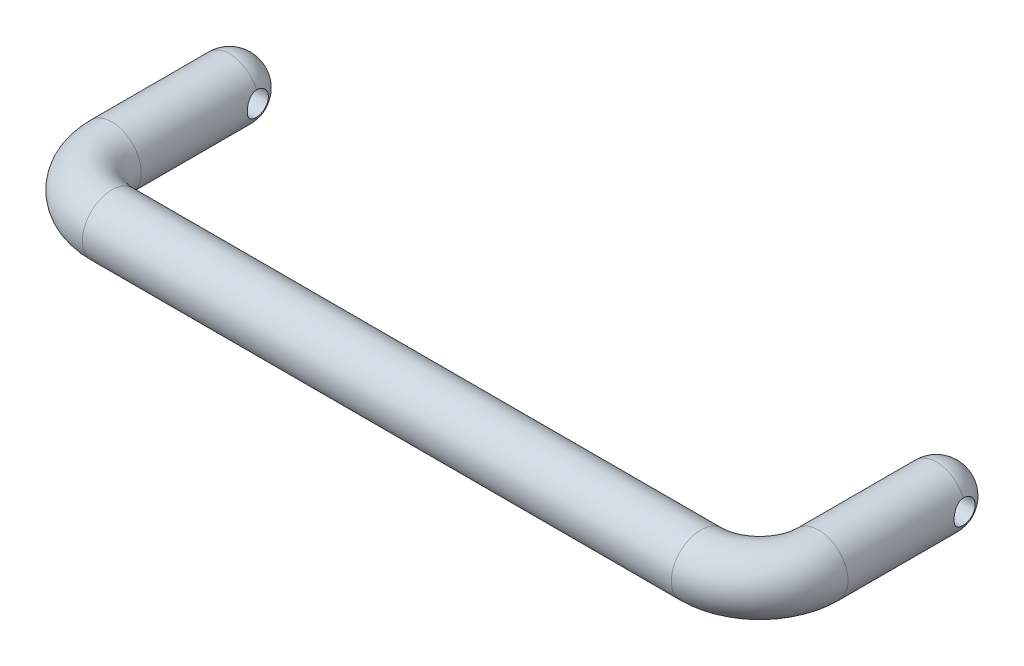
ISO-10303-21;
HEADER;
FILE_DESCRIPTION(('STEP AP214'),'2;1');
FILE_NAME('part.step','',(''),(''),'','','');
FILE_SCHEMA(('AUTOMOTIVE_DESIGN { 1 0 10303 214 1 1 1 1 }'));
ENDSEC;
DATA;
#1=APPLICATION_CONTEXT('core data for automotive mechanical design processes');
#2=APPLICATION_PROTOCOL_DEFINITION('international standard','automotive_design',2000,#1);
#3=PRODUCT_CONTEXT('',#1,'mechanical');
#4=PRODUCT('Part','Part','',(#3));
#5=PRODUCT_RELATED_PRODUCT_CATEGORY('part','',(#4));
#6=PRODUCT_DEFINITION_FORMATION('','',#4);
#7=PRODUCT_DEFINITION_CONTEXT('part definition',#1,'design');
#8=PRODUCT_DEFINITION('design','',#6,#7);
#9=PRODUCT_DEFINITION_SHAPE('','',#8);
#10=(LENGTH_UNIT() NAMED_UNIT(*) SI_UNIT(.MILLI.,.METRE.));
#11=(NAMED_UNIT(*) PLANE_ANGLE_UNIT() SI_UNIT($,.RADIAN.));
#12=(NAMED_UNIT(*) SI_UNIT($,.STERADIAN.) SOLID_ANGLE_UNIT());
#13=UNCERTAINTY_MEASURE_WITH_UNIT(LENGTH_MEASURE(1.E-05),#10,'distance_accuracy_value','');
#14=(GEOMETRIC_REPRESENTATION_CONTEXT(3) GLOBAL_UNCERTAINTY_ASSIGNED_CONTEXT((#13)) GLOBAL_UNIT_ASSIGNED_CONTEXT((#10,
#11,#12)) REPRESENTATION_CONTEXT('',''));
#15=CARTESIAN_POINT('',(0.,0.,0.));
#16=DIRECTION('',(0.,0.,1.));
#17=DIRECTION('',(1.,0.,0.));
#18=AXIS2_PLACEMENT_3D('',#15,#16,#17);
#19=CARTESIAN_POINT('',(120.,0.,20.));
#20=DIRECTION('',(0.,0.,-1.));
#21=DIRECTION('',(0.,1.,0.));
#22=AXIS2_PLACEMENT_3D('',#19,#20,#21);
#23=CYLINDRICAL_SURFACE('',#22,5.);
#24=CARTESIAN_POINT('',(124.582575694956,2.,0.));
#25=CARTESIAN_POINT('',(124.582564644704,2.00000798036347,0.0538058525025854));
#26=CARTESIAN_POINT('',(124.583523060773,1.99782891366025,0.10760566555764));
#27=CARTESIAN_POINT('',(124.587296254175,1.98915905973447,0.214771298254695));
#28=CARTESIAN_POINT('',(124.590110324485,1.98266991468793,0.268137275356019));
#29=CARTESIAN_POINT('',(124.597497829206,1.9654760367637,0.373846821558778));
#30=CARTESIAN_POINT('',(124.602064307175,1.95478796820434,0.42619358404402));
#31=CARTESIAN_POINT('',(124.612800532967,1.92931630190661,0.529700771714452));
#32=CARTESIAN_POINT('',(124.618970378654,1.91453245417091,0.580861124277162));
#33=CARTESIAN_POINT('',(124.639592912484,1.86426971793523,0.731935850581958));
#34=CARTESIAN_POINT('',(124.656174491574,1.82284489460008,0.829654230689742));
#35=CARTESIAN_POINT('',(124.693123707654,1.72548191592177,1.01679558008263));
#36=CARTESIAN_POINT('',(124.71349493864,1.66952996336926,1.10621055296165));
#37=CARTESIAN_POINT('',(124.757009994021,1.54131835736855,1.27926239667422));
#38=CARTESIAN_POINT('',(124.780242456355,1.46836913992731,1.36236721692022));
#39=CARTESIAN_POINT('',(124.826127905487,1.30969646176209,1.51554027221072));
#40=CARTESIAN_POINT('',(124.848780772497,1.22397038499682,1.58560583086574));
#41=CARTESIAN_POINT('',(124.892034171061,1.03800590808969,1.71340639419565));
#42=CARTESIAN_POINT('',(124.912518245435,0.937327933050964,1.77054480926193));
#43=CARTESIAN_POINT('',(124.94803944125,0.726824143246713,1.86684407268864));
#44=CARTESIAN_POINT('',(124.963078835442,0.617002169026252,1.90601242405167));
#45=CARTESIAN_POINT('',(124.985383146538,0.3969674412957,1.96334120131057));
#46=CARTESIAN_POINT('',(124.992989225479,0.287031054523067,1.98242695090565));
#47=CARTESIAN_POINT('',(125.000803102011,0.0652684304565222,2.00202847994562));
#48=CARTESIAN_POINT('',(125.00101352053,-0.0465571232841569,2.00255083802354));
#49=CARTESIAN_POINT('',(124.994219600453,-0.26223337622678,1.98551716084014));
#50=CARTESIAN_POINT('',(124.987619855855,-0.366179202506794,1.968974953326));
#51=CARTESIAN_POINT('',(124.968492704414,-0.56967478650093,1.92000657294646));
#52=CARTESIAN_POINT('',(124.955964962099,-0.669224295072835,1.88757950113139));
#53=CARTESIAN_POINT('',(124.925968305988,-0.862897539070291,1.80736370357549));
#54=CARTESIAN_POINT('',(124.908427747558,-0.956916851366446,1.75935075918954));
#55=CARTESIAN_POINT('',(124.87014602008,-1.13580746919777,1.64953541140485));
#56=CARTESIAN_POINT('',(124.849403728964,-1.22067554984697,1.58772817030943));
#57=CARTESIAN_POINT('',(124.805217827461,-1.38476339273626,1.44735581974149));
#58=CARTESIAN_POINT('',(124.781686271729,-1.46324770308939,1.36795752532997));
#59=CARTESIAN_POINT('',(124.735619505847,-1.60609926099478,1.19701990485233));
#60=CARTESIAN_POINT('',(124.713084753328,-1.67046007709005,1.10547507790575));
#61=CARTESIAN_POINT('',(124.67095688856,-1.78493657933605,0.909529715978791));
#62=CARTESIAN_POINT('',(124.651467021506,-1.83458932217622,0.804835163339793));
#63=CARTESIAN_POINT('',(124.618861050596,-1.91521298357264,0.587638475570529));
#64=CARTESIAN_POINT('',(124.605733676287,-1.94621696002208,0.47515055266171));
#65=CARTESIAN_POINT('',(124.592083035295,-1.9781058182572,0.301256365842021));
#66=CARTESIAN_POINT('',(124.588534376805,-1.98630505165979,0.241342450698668));
#67=CARTESIAN_POINT('',(124.583775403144,-1.99725282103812,0.120964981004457));
#68=CARTESIAN_POINT('',(124.582563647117,-2.00000471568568,0.0605017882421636));
#69=CARTESIAN_POINT('',(124.582575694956,-2.,0.));
#70=B_SPLINE_CURVE_WITH_KNOTS('',3,(#24,#25,#26,#27,#28,#29,#30,#31,#32,#33,#34,#35,#36,#37,#38,
#39,#40,#41,#42,#43,#44,#45,#46,#47,#48,#49,#50,#51,#52,#53,#54,#55,#56,#57,#58,#59,#60,#61,#62,
#63,#64,#65,#66,#67,#68,#69),.UNSPECIFIED.,.F.,.F.,(4,2,2,2,2,2,2,2,2,2,2,2,2,2,2,2,2,2,2,2,2,2,
4),(0.,0.161354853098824,0.322648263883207,0.483307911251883,0.643977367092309,
0.964683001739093,1.28569434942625,1.62318047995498,1.96073580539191,2.31162858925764,
2.66237473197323,2.9961387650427,3.32978451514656,3.64468915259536,3.95961161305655,
4.27928176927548,4.59906421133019,4.93981874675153,5.28072813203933,5.63144241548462,
5.98153315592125,6.16300192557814,6.34435877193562),.UNSPECIFIED.);
#71=CARTESIAN_POINT('',(124.582575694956,2.,0.));
#72=VERTEX_POINT('',#71);
#73=CARTESIAN_POINT('',(124.582575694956,-2.,0.));
#74=VERTEX_POINT('',#73);
#75=EDGE_CURVE('E66',#72,#74,#70,.T.);
#76=ORIENTED_EDGE('',*,*,#75,.F.);
#77=CARTESIAN_POINT('',(120.,0.,0.));
#78=DIRECTION('',(0.,0.,-1.));
#79=DIRECTION('',(0.,-1.,0.));
#80=AXIS2_PLACEMENT_3D('',#77,#78,#79);
#81=CIRCLE('',#80,5.);
#82=CARTESIAN_POINT('',(115.417424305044,2.00000000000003,0.));
#83=VERTEX_POINT('',#82);
#84=EDGE_CURVE('E60',#83,#72,#81,.T.);
#85=ORIENTED_EDGE('',*,*,#84,.F.);
#86=CARTESIAN_POINT('',(115.417424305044,-2.,0.));
#87=CARTESIAN_POINT('',(115.417435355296,-2.00000798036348,0.0538058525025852));
#88=CARTESIAN_POINT('',(115.416476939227,-1.99782891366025,0.107605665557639));
#89=CARTESIAN_POINT('',(115.412703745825,-1.98915905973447,0.214771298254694));
#90=CARTESIAN_POINT('',(115.409889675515,-1.98266991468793,0.268137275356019));
#91=CARTESIAN_POINT('',(115.402502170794,-1.9654760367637,0.373846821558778));
#92=CARTESIAN_POINT('',(115.397935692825,-1.95478796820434,0.426193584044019));
#93=CARTESIAN_POINT('',(115.387199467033,-1.92931630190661,0.529700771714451));
#94=CARTESIAN_POINT('',(115.381029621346,-1.91453245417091,0.580861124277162));
#95=CARTESIAN_POINT('',(115.360407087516,-1.86426971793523,0.73193585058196));
#96=CARTESIAN_POINT('',(115.343825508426,-1.82284489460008,0.829654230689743));
#97=CARTESIAN_POINT('',(115.306876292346,-1.72548191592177,1.01679558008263));
#98=CARTESIAN_POINT('',(115.28650506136,-1.66952996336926,1.10621055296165));
#99=CARTESIAN_POINT('',(115.242990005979,-1.54131835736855,1.27926239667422));
#100=CARTESIAN_POINT('',(115.219757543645,-1.46836913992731,1.36236721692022));
#101=CARTESIAN_POINT('',(115.173872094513,-1.3096964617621,1.51554027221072));
#102=CARTESIAN_POINT('',(115.151219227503,-1.22397038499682,1.58560583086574));
#103=CARTESIAN_POINT('',(115.107965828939,-1.03800590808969,1.71340639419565));
#104=CARTESIAN_POINT('',(115.087481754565,-0.937327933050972,1.77054480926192));
#105=CARTESIAN_POINT('',(115.05196055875,-0.726824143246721,1.86684407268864));
#106=CARTESIAN_POINT('',(115.036921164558,-0.617002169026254,1.90601242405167));
#107=CARTESIAN_POINT('',(115.014616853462,-0.396967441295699,1.96334120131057));
#108=CARTESIAN_POINT('',(115.007010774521,-0.287031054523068,1.98242695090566));
#109=CARTESIAN_POINT('',(114.999196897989,-0.0652684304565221,2.00202847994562));
#110=CARTESIAN_POINT('',(114.99898647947,0.0465571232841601,2.00255083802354));
#111=CARTESIAN_POINT('',(115.005780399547,0.262233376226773,1.98551716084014));
#112=CARTESIAN_POINT('',(115.012380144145,0.366179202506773,1.968974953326));
#113=CARTESIAN_POINT('',(115.031507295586,0.569674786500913,1.92000657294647));
#114=CARTESIAN_POINT('',(115.044035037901,0.669224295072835,1.88757950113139));
#115=CARTESIAN_POINT('',(115.074031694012,0.862897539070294,1.80736370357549));
#116=CARTESIAN_POINT('',(115.091572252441,0.956916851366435,1.75935075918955));
#117=CARTESIAN_POINT('',(115.12985397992,1.13580746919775,1.64953541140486));
#118=CARTESIAN_POINT('',(115.150596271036,1.22067554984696,1.58772817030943));
#119=CARTESIAN_POINT('',(115.194782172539,1.38476339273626,1.44735581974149));
#120=CARTESIAN_POINT('',(115.218313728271,1.4632477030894,1.36795752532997));
#121=CARTESIAN_POINT('',(115.264380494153,1.60609926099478,1.19701990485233));
#122=CARTESIAN_POINT('',(115.286915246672,1.67046007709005,1.10547507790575));
#123=CARTESIAN_POINT('',(115.32904311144,1.78493657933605,0.9095297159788));
#124=CARTESIAN_POINT('',(115.348532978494,1.83458932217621,0.804835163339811));
#125=CARTESIAN_POINT('',(115.381138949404,1.91521298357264,0.587638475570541));
#126=CARTESIAN_POINT('',(115.394266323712,1.94621696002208,0.475150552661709));
#127=CARTESIAN_POINT('',(115.407916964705,1.9781058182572,0.301256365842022));
#128=CARTESIAN_POINT('',(115.411465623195,1.98630505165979,0.241342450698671));
#129=CARTESIAN_POINT('',(115.416224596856,1.99725282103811,0.120964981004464));
#130=CARTESIAN_POINT('',(115.417436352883,2.00000471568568,0.0605017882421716));
#131=CARTESIAN_POINT('',(115.417424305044,2.,0.));
#132=B_SPLINE_CURVE_WITH_KNOTS('',3,(#86,#87,#88,#89,#90,#91,#92,#93,#94,#95,#96,#97,#98,#99,
#100,#101,#102,#103,#104,#105,#106,#107,#108,#109,#110,#111,#112,#113,#114,#115,#116,#117,#118,
#119,#120,#121,#122,#123,#124,#125,#126,#127,#128,#129,#130,#131),.UNSPECIFIED.,.F.,.F.,(4,2,2,
2,2,2,2,2,2,2,2,2,2,2,2,2,2,2,2,2,2,2,4),(0.,0.161354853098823,0.322648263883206,
0.483307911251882,0.643977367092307,0.964683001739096,1.28569434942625,1.62318047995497,
1.9607358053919,2.31162858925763,2.66237473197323,2.9961387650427,3.32978451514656,
3.64468915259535,3.95961161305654,4.27928176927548,4.59906421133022,4.93981874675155,
5.28072813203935,5.63144241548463,5.98153315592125,6.16300192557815,6.34435877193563),.UNSPECIFIED.);
#133=CARTESIAN_POINT('',(115.417424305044,-2.00000000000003,0.));
#134=VERTEX_POINT('',#133);
#135=EDGE_CURVE('E55',#134,#83,#132,.T.);
#136=ORIENTED_EDGE('',*,*,#135,.F.);
#137=EDGE_CURVE('E65',#74,#134,#81,.T.);
#138=ORIENTED_EDGE('',*,*,#137,.F.);
#139=EDGE_LOOP('',(#76,#85,#136,#138));
#140=FACE_BOUND('',#139,.T.);
#141=CARTESIAN_POINT('',(120.,0.,20.));
#142=DIRECTION('',(0.,0.,-1.));
#143=DIRECTION('',(0.,-1.,0.));
#144=AXIS2_PLACEMENT_3D('',#141,#142,#143);
#145=CIRCLE('',#144,5.);
#146=CARTESIAN_POINT('',(125.,0.,20.));
#147=VERTEX_POINT('',#146);
#148=EDGE_CURVE('E70',#147,#147,#145,.T.);
#149=ORIENTED_EDGE('',*,*,#148,.T.);
#150=EDGE_LOOP('',(#149));
#151=FACE_BOUND('',#150,.T.);
#152=ADVANCED_FACE('F14',(#140,#151),#23,.T.);
#153=CARTESIAN_POINT('',(110.,0.,20.));
#154=DIRECTION('',(0.,1.,0.));
#155=DIRECTION('',(-1.,0.,0.));
#156=AXIS2_PLACEMENT_3D('',#153,#154,#155);
#157=TOROIDAL_SURFACE('',#156,10.,5.);
#158=CARTESIAN_POINT('',(110.,0.,30.));
#159=DIRECTION('',(1.,0.,0.));
#160=DIRECTION('',(0.,-1.,0.));
#161=AXIS2_PLACEMENT_3D('',#158,#159,#160);
#162=CIRCLE('',#161,5.);
#163=CARTESIAN_POINT('',(110.,0.,35.));
#164=VERTEX_POINT('',#163);
#165=EDGE_CURVE('E73',#164,#164,#162,.T.);
#166=CARTESIAN_POINT('',(110.,0.,20.));
#167=DIRECTION('',(0.,1.,0.));
#168=DIRECTION('',(-1.,0.,0.));
#169=AXIS2_PLACEMENT_3D('',#166,#167,#168);
#170=CIRCLE('',#169,15.);
#171=EDGE_CURVE('',#164,#147,#170,.T.);
#172=ORIENTED_EDGE('',*,*,#165,.T.);
#173=ORIENTED_EDGE('',*,*,#148,.F.);
#174=ORIENTED_EDGE('',*,*,#171,.T.);
#175=ORIENTED_EDGE('',*,*,#171,.F.);
#176=EDGE_LOOP('',(#172,#174,#173,#175));
#177=FACE_BOUND('',#176,.T.);
#178=ADVANCED_FACE('F136',(#177),#157,.T.);
#179=CARTESIAN_POINT('',(10.,0.,30.));
#180=DIRECTION('',(1.,0.,0.));
#181=DIRECTION('',(0.,1.,0.));
#182=AXIS2_PLACEMENT_3D('',#179,#180,#181);
#183=CYLINDRICAL_SURFACE('',#182,5.);
#184=CARTESIAN_POINT('',(10.,0.,30.));
#185=DIRECTION('',(1.,0.,0.));
#186=DIRECTION('',(0.,-1.,0.));
#187=AXIS2_PLACEMENT_3D('',#184,#185,#186);
#188=CIRCLE('',#187,5.);
#189=CARTESIAN_POINT('',(10.,0.,35.));
#190=VERTEX_POINT('',#189);
#191=EDGE_CURVE('E78',#190,#190,#188,.T.);
#192=ORIENTED_EDGE('',*,*,#191,.T.);
#193=EDGE_LOOP('',(#192));
#194=FACE_BOUND('',#193,.T.);
#195=ORIENTED_EDGE('',*,*,#165,.F.);
#196=EDGE_LOOP('',(#195));
#197=FACE_BOUND('',#196,.T.);
#198=ADVANCED_FACE('F141',(#194,#197),#183,.T.);
#199=CARTESIAN_POINT('',(10.,0.,20.));
#200=DIRECTION('',(0.,1.,0.));
#201=DIRECTION('',(-1.,0.,0.));
#202=AXIS2_PLACEMENT_3D('',#199,#200,#201);
#203=TOROIDAL_SURFACE('',#202,10.,5.);
#204=CARTESIAN_POINT('',(0.,0.,20.));
#205=DIRECTION('',(0.,0.,1.));
#206=DIRECTION('',(0.,-1.,0.));
#207=AXIS2_PLACEMENT_3D('',#204,#205,#206);
#208=CIRCLE('',#207,5.);
#209=CARTESIAN_POINT('',(-5.,0.,20.));
#210=VERTEX_POINT('',#209);
#211=EDGE_CURVE('E81',#210,#210,#208,.T.);
#212=CARTESIAN_POINT('',(10.,0.,20.));
#213=DIRECTION('',(0.,1.,0.));
#214=DIRECTION('',(-1.,0.,0.));
#215=AXIS2_PLACEMENT_3D('',#212,#213,#214);
#216=CIRCLE('',#215,15.);
#217=EDGE_CURVE('',#210,#190,#216,.T.);
#218=ORIENTED_EDGE('',*,*,#211,.T.);
#219=ORIENTED_EDGE('',*,*,#191,.F.);
#220=ORIENTED_EDGE('',*,*,#217,.T.);
#221=ORIENTED_EDGE('',*,*,#217,.F.);
#222=EDGE_LOOP('',(#218,#220,#219,#221));
#223=FACE_BOUND('',#222,.T.);
#224=ADVANCED_FACE('F147',(#223),#203,.T.);
#225=CARTESIAN_POINT('',(0.,0.,20.));
#226=DIRECTION('',(0.,0.,-1.));
#227=DIRECTION('',(0.,1.,0.));
#228=AXIS2_PLACEMENT_3D('',#225,#226,#227);
#229=CYLINDRICAL_SURFACE('',#228,5.);
#230=ORIENTED_EDGE('',*,*,#211,.F.);
#231=EDGE_LOOP('',(#230));
#232=FACE_BOUND('',#231,.T.);
#233=CARTESIAN_POINT('',(0.,0.,0.));
#234=DIRECTION('',(0.,0.,-1.));
#235=DIRECTION('',(0.,1.,0.));
#236=AXIS2_PLACEMENT_3D('',#233,#234,#235);
#237=CIRCLE('',#236,5.);
#238=CARTESIAN_POINT('',(-4.5825756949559,2.,0.));
#239=VERTEX_POINT('',#238);
#240=CARTESIAN_POINT('',(4.5825756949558,2.,0.));
#241=VERTEX_POINT('',#240);
#242=EDGE_CURVE('E85',#239,#241,#237,.T.);
#243=ORIENTED_EDGE('',*,*,#242,.F.);
#244=CARTESIAN_POINT('',(-4.5825756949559,2.,0.));
#245=CARTESIAN_POINT('',(-4.58256464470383,2.00000798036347,0.0538058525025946));
#246=CARTESIAN_POINT('',(-4.58352306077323,1.99782891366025,0.10760566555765));
#247=CARTESIAN_POINT('',(-4.58729625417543,1.98915905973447,0.214771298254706));
#248=CARTESIAN_POINT('',(-4.59011032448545,1.98266991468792,0.26813727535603));
#249=CARTESIAN_POINT('',(-4.59749782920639,1.9654760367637,0.373846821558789));
#250=CARTESIAN_POINT('',(-4.60206430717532,1.95478796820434,0.42619358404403));
#251=CARTESIAN_POINT('',(-4.61280053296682,1.9293163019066,0.52970077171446));
#252=CARTESIAN_POINT('',(-4.61897037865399,1.9145324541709,0.580861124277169));
#253=CARTESIAN_POINT('',(-4.63959291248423,1.86426971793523,0.731935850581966));
#254=CARTESIAN_POINT('',(-4.65617449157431,1.82284489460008,0.82965423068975));
#255=CARTESIAN_POINT('',(-4.69312370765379,1.72548191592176,1.01679558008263));
#256=CARTESIAN_POINT('',(-4.71349493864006,1.66952996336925,1.10621055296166));
#257=CARTESIAN_POINT('',(-4.75700999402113,1.54131835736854,1.27926239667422));
#258=CARTESIAN_POINT('',(-4.78024245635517,1.4683691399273,1.36236721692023));
#259=CARTESIAN_POINT('',(-4.82612790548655,1.30969646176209,1.51554027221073));
#260=CARTESIAN_POINT('',(-4.84878077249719,1.22397038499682,1.58560583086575));
#261=CARTESIAN_POINT('',(-4.8920341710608,1.03800590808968,1.71340639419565));
#262=CARTESIAN_POINT('',(-4.91251824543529,0.937327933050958,1.77054480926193));
#263=CARTESIAN_POINT('',(-4.94803944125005,0.726824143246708,1.86684407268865));
#264=CARTESIAN_POINT('',(-4.96307883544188,0.617002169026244,1.90601242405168));
#265=CARTESIAN_POINT('',(-4.98538314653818,0.39696744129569,1.96334120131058));
#266=CARTESIAN_POINT('',(-4.99298922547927,0.287031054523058,1.98242695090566));
#267=CARTESIAN_POINT('',(-5.00080310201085,0.0652684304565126,2.00202847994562));
#268=CARTESIAN_POINT('',(-5.00101352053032,-0.0465571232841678,2.00255083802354));
#269=CARTESIAN_POINT('',(-4.99421960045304,-0.262233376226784,1.98551716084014));
#270=CARTESIAN_POINT('',(-4.98761985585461,-0.36617920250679,1.968974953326));
#271=CARTESIAN_POINT('',(-4.96849270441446,-0.569674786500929,1.92000657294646));
#272=CARTESIAN_POINT('',(-4.95596496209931,-0.669224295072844,1.88757950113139));
#273=CARTESIAN_POINT('',(-4.92596830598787,-0.862897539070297,1.80736370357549));
#274=CARTESIAN_POINT('',(-4.90842774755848,-0.956916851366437,1.75935075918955));
#275=CARTESIAN_POINT('',(-4.87014602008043,-1.13580746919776,1.64953541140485));
#276=CARTESIAN_POINT('',(-4.8494037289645,-1.22067554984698,1.58772817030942));
#277=CARTESIAN_POINT('',(-4.80521782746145,-1.38476339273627,1.44735581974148));
#278=CARTESIAN_POINT('',(-4.78168627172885,-1.4632477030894,1.36795752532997));
#279=CARTESIAN_POINT('',(-4.7356195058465,-1.60609926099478,1.19701990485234));
#280=CARTESIAN_POINT('',(-4.71308475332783,-1.67046007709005,1.10547507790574));
#281=CARTESIAN_POINT('',(-4.67095688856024,-1.78493657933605,0.909529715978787));
#282=CARTESIAN_POINT('',(-4.65146702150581,-1.83458932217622,0.804835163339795));
#283=CARTESIAN_POINT('',(-4.61886105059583,-1.91521298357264,0.587638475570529));
#284=CARTESIAN_POINT('',(-4.60573367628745,-1.94621696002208,0.475150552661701));
#285=CARTESIAN_POINT('',(-4.59208303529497,-1.9781058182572,0.301256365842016));
#286=CARTESIAN_POINT('',(-4.58853437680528,-1.98630505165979,0.241342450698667));
#287=CARTESIAN_POINT('',(-4.58377540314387,-1.99725282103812,0.120964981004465));
#288=CARTESIAN_POINT('',(-4.58256364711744,-2.00000471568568,0.0605017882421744));
#289=CARTESIAN_POINT('',(-4.5825756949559,-2.,0.));
#290=B_SPLINE_CURVE_WITH_KNOTS('',3,(#244,#245,#246,#247,#248,#249,#250,#251,#252,#253,#254,
#255,#256,#257,#258,#259,#260,#261,#262,#263,#264,#265,#266,#267,#268,#269,#270,#271,#272,#273,
#274,#275,#276,#277,#278,#279,#280,#281,#282,#283,#284,#285,#286,#287,#288,#289),.UNSPECIFIED.,
.F.,.F.,(4,2,2,2,2,2,2,2,2,2,2,2,2,2,2,2,2,2,2,2,2,2,4),(0.,0.161354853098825,0.32264826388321,
0.483307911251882,0.643977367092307,0.964683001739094,1.28569434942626,1.62318047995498,
1.96073580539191,2.31162858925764,2.66237473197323,2.9961387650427,3.32978451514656,
3.64468915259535,3.95961161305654,4.27928176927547,4.59906421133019,4.93981874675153,
5.28072813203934,5.63144241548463,5.98153315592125,6.16300192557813,6.3443587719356),.UNSPECIFIED.);
#291=CARTESIAN_POINT('',(-4.5825756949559,-2.,0.));
#292=VERTEX_POINT('',#291);
#293=EDGE_CURVE('E28',#239,#292,#290,.T.);
#294=ORIENTED_EDGE('',*,*,#293,.T.);
#295=CARTESIAN_POINT('',(4.5825756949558,-2.,0.));
#296=VERTEX_POINT('',#295);
#297=EDGE_CURVE('E84',#296,#292,#237,.T.);
#298=ORIENTED_EDGE('',*,*,#297,.F.);
#299=CARTESIAN_POINT('',(4.5825756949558,-2.,0.));
#300=CARTESIAN_POINT('',(4.5825646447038,-2.00000798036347,0.053805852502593));
#301=CARTESIAN_POINT('',(4.58352306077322,-1.99782891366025,0.107605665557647));
#302=CARTESIAN_POINT('',(4.58729625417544,-1.98915905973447,0.214771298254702));
#303=CARTESIAN_POINT('',(4.59011032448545,-1.98266991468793,0.268137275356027));
#304=CARTESIAN_POINT('',(4.59749782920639,-1.9654760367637,0.373846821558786));
#305=CARTESIAN_POINT('',(4.60206430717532,-1.95478796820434,0.426193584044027));
#306=CARTESIAN_POINT('',(4.61280053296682,-1.9293163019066,0.529700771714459));
#307=CARTESIAN_POINT('',(4.61897037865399,-1.9145324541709,0.580861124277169));
#308=CARTESIAN_POINT('',(4.63959291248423,-1.86426971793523,0.731935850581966));
#309=CARTESIAN_POINT('',(4.65617449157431,-1.82284489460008,0.829654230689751));
#310=CARTESIAN_POINT('',(4.69312370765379,-1.72548191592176,1.01679558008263));
#311=CARTESIAN_POINT('',(4.71349493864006,-1.66952996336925,1.10621055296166));
#312=CARTESIAN_POINT('',(4.75700999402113,-1.54131835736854,1.27926239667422));
#313=CARTESIAN_POINT('',(4.78024245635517,-1.4683691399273,1.36236721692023));
#314=CARTESIAN_POINT('',(4.82612790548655,-1.30969646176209,1.51554027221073));
#315=CARTESIAN_POINT('',(4.84878077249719,-1.22397038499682,1.58560583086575));
#316=CARTESIAN_POINT('',(4.8920341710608,-1.03800590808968,1.71340639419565));
#317=CARTESIAN_POINT('',(4.91251824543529,-0.937327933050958,1.77054480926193));
#318=CARTESIAN_POINT('',(4.94803944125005,-0.726824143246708,1.86684407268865));
#319=CARTESIAN_POINT('',(4.96307883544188,-0.617002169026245,1.90601242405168));
#320=CARTESIAN_POINT('',(4.98538314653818,-0.396967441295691,1.96334120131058));
#321=CARTESIAN_POINT('',(4.99298922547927,-0.287031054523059,1.98242695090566));
#322=CARTESIAN_POINT('',(5.00080310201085,-0.0652684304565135,2.00202847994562));
#323=CARTESIAN_POINT('',(5.00101352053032,0.0465571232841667,2.00255083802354));
#324=CARTESIAN_POINT('',(4.99421960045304,0.262233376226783,1.98551716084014));
#325=CARTESIAN_POINT('',(4.98761985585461,0.366179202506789,1.968974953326));
#326=CARTESIAN_POINT('',(4.96849270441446,0.569674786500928,1.92000657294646));
#327=CARTESIAN_POINT('',(4.95596496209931,0.669224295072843,1.88757950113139));
#328=CARTESIAN_POINT('',(4.92596830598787,0.862897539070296,1.80736370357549));
#329=CARTESIAN_POINT('',(4.90842774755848,0.956916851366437,1.75935075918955));
#330=CARTESIAN_POINT('',(4.87014602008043,1.13580746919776,1.64953541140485));
#331=CARTESIAN_POINT('',(4.8494037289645,1.22067554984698,1.58772817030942));
#332=CARTESIAN_POINT('',(4.80521782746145,1.38476339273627,1.44735581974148));
#333=CARTESIAN_POINT('',(4.78168627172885,1.4632477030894,1.36795752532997));
#334=CARTESIAN_POINT('',(4.73561950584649,1.60609926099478,1.19701990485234));
#335=CARTESIAN_POINT('',(4.71308475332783,1.67046007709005,1.10547507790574));
#336=CARTESIAN_POINT('',(4.67095688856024,1.78493657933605,0.909529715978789));
#337=CARTESIAN_POINT('',(4.65146702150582,1.83458932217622,0.804835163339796));
#338=CARTESIAN_POINT('',(4.61886105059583,1.91521298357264,0.58763847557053));
#339=CARTESIAN_POINT('',(4.60573367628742,1.94621696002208,0.475150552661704));
#340=CARTESIAN_POINT('',(4.59208303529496,1.9781058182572,0.301256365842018));
#341=CARTESIAN_POINT('',(4.58853437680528,1.98630505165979,0.241342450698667));
#342=CARTESIAN_POINT('',(4.58377540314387,1.99725282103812,0.120964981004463));
#343=CARTESIAN_POINT('',(4.58256364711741,2.00000471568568,0.0605017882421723));
#344=CARTESIAN_POINT('',(4.5825756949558,2.,0.));
#345=B_SPLINE_CURVE_WITH_KNOTS('',3,(#299,#300,#301,#302,#303,#304,#305,#306,#307,#308,#309,
#310,#311,#312,#313,#314,#315,#316,#317,#318,#319,#320,#321,#322,#323,#324,#325,#326,#327,#328,
#329,#330,#331,#332,#333,#334,#335,#336,#337,#338,#339,#340,#341,#342,#343,#344),.UNSPECIFIED.,
.F.,.F.,(4,2,2,2,2,2,2,2,2,2,2,2,2,2,2,2,2,2,2,2,2,2,4),(0.,0.161354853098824,0.322648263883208,
0.483307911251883,0.643977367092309,0.964683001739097,1.28569434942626,1.62318047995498,
1.96073580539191,2.31162858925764,2.66237473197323,2.9961387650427,3.32978451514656,
3.64468915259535,3.95961161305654,4.27928176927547,4.59906421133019,4.93981874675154,
5.28072813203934,5.63144241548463,5.98153315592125,6.16300192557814,6.34435877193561),.UNSPECIFIED.);
#346=EDGE_CURVE('E35',#296,#241,#345,.T.);
#347=ORIENTED_EDGE('',*,*,#346,.T.);
#348=EDGE_LOOP('',(#243,#294,#298,#347));
#349=FACE_BOUND('',#348,.T.);
#350=ADVANCED_FACE('F97',(#232,#349),#229,.T.);
#351=CARTESIAN_POINT('',(0.,0.,0.));
#352=DIRECTION('',(-1.,0.,0.));
#353=DIRECTION('',(0.,-1.,0.));
#354=AXIS2_PLACEMENT_3D('',#351,#352,#353);
#355=SPHERICAL_SURFACE('',#354,5.);
#356=CARTESIAN_POINT('',(4.5825756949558,0.,0.));
#357=DIRECTION('',(-1.,0.,0.));
#358=DIRECTION('',(0.,-1.,0.));
#359=AXIS2_PLACEMENT_3D('',#356,#357,#358);
#360=CIRCLE('',#359,2.);
#361=EDGE_CURVE('E95',#296,#241,#360,.F.);
#362=ORIENTED_EDGE('',*,*,#361,.F.);
#363=ORIENTED_EDGE('',*,*,#297,.T.);
#364=CARTESIAN_POINT('',(-4.5825756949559,0.,0.));
#365=DIRECTION('',(1.,0.,0.));
#366=DIRECTION('',(0.,1.,0.));
#367=AXIS2_PLACEMENT_3D('',#364,#365,#366);
#368=CIRCLE('',#367,2.);
#369=EDGE_CURVE('E123',#239,#292,#368,.F.);
#370=ORIENTED_EDGE('',*,*,#369,.F.);
#371=ORIENTED_EDGE('',*,*,#242,.T.);
#372=EDGE_LOOP('',(#362,#363,#370,#371));
#373=FACE_BOUND('',#372,.T.);
#374=ADVANCED_FACE('F129',(#373),#355,.T.);
#375=CARTESIAN_POINT('',(120.,0.,0.));
#376=DIRECTION('',(1.,0.,0.));
#377=DIRECTION('',(0.,-1.,0.));
#378=AXIS2_PLACEMENT_3D('',#375,#376,#377);
#379=SPHERICAL_SURFACE('',#378,5.);
#380=CARTESIAN_POINT('',(124.582575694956,0.,0.));
#381=DIRECTION('',(-1.,0.,0.));
#382=DIRECTION('',(0.,-1.,0.));
#383=AXIS2_PLACEMENT_3D('',#380,#381,#382);
#384=CIRCLE('',#383,2.);
#385=EDGE_CURVE('E9',#74,#72,#384,.F.);
#386=ORIENTED_EDGE('',*,*,#385,.F.);
#387=ORIENTED_EDGE('',*,*,#137,.T.);
#388=CARTESIAN_POINT('',(115.417424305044,0.,0.));
#389=DIRECTION('',(1.,0.,0.));
#390=DIRECTION('',(0.,1.,0.));
#391=AXIS2_PLACEMENT_3D('',#388,#389,#390);
#392=CIRCLE('',#391,2.);
#393=EDGE_CURVE('E22',#83,#134,#392,.F.);
#394=ORIENTED_EDGE('',*,*,#393,.F.);
#395=ORIENTED_EDGE('',*,*,#84,.T.);
#396=EDGE_LOOP('',(#386,#387,#394,#395));
#397=FACE_BOUND('',#396,.T.);
#398=ADVANCED_FACE('F69',(#397),#379,.T.);
#399=CARTESIAN_POINT('',(-10.,0.,0.));
#400=DIRECTION('',(1.,0.,0.));
#401=DIRECTION('',(0.,1.,0.));
#402=AXIS2_PLACEMENT_3D('',#399,#400,#401);
#403=CYLINDRICAL_SURFACE('',#402,2.);
#404=ORIENTED_EDGE('',*,*,#75,.T.);
#405=ORIENTED_EDGE('',*,*,#385,.T.);
#406=EDGE_LOOP('',(#404,#405));
#407=FACE_BOUND('',#406,.T.);
#408=ORIENTED_EDGE('',*,*,#135,.T.);
#409=ORIENTED_EDGE('',*,*,#393,.T.);
#410=EDGE_LOOP('',(#408,#409));
#411=FACE_BOUND('',#410,.T.);
#412=ADVANCED_FACE('F54',(#407,#411),#403,.F.);
#413=ORIENTED_EDGE('',*,*,#369,.T.);
#414=ORIENTED_EDGE('',*,*,#293,.F.);
#415=EDGE_LOOP('',(#413,#414));
#416=FACE_BOUND('',#415,.T.);
#417=ORIENTED_EDGE('',*,*,#361,.T.);
#418=ORIENTED_EDGE('',*,*,#346,.F.);
#419=EDGE_LOOP('',(#417,#418));
#420=FACE_BOUND('',#419,.T.);
#421=ADVANCED_FACE('F104',(#416,#420),#403,.F.);
#422=CLOSED_SHELL('',(#152,#178,#198,#224,#350,#374,#398,#412,#421));
#423=MANIFOLD_SOLID_BREP('B1',#422);
#424=ADVANCED_BREP_SHAPE_REPRESENTATION('',(#18,#423),#14);
#425=SHAPE_DEFINITION_REPRESENTATION(#9,#424);
ENDSEC;
END-ISO-10303-21;
